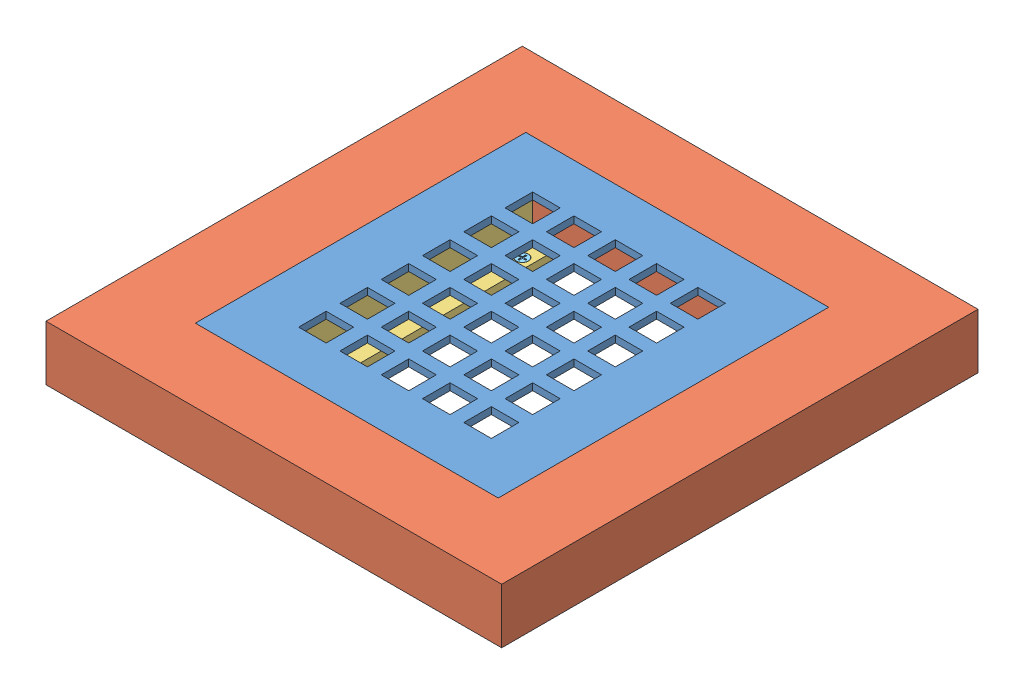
SolidWorks assembly 608(STEP 6A) - Copy.SLDASM, configuration Default (file format 11000). Lengths in mm.
Overall size (139.7 25.4 152.4).
12 component instances, 5 part files, 22 mates.
Components (placement in the parent):
- 208 Lattice Perforated Grille-1: 208 Lattice Perforated Grille.SLDPRT [Default] at origin size (139.7 3.17 152.4)
- wallORfloorORceiling-1: wallORfloorORceiling.SLDPRT [Default] at (0 -23.8125 0) x (0 0 -1) z (0 1 0) size (219.7 210.18 25.4) (hidden)
- Angle-1: Angle.SLDPRT [Default] at (-50.8 -1.5875 -57.15) size (12.7 22.23 114.3)
- Angle-2: Angle.SLDPRT [Default] at (50.8 -1.5875 57.15) x (-1 0 0) z (0 0 -1) size (12.7 22.23 114.3)
- Blocking(Supplied By Contractor)-1: Blocking(Supplied By Contractor).SLDPRT [Default] at (-52.3875 -28.575 38.1) size (38.1 9.53 19.05) (hidden)
- Blocking(Supplied By Contractor)-2: Blocking(Supplied By Contractor).SLDPRT [Default] at (-52.3875 -28.575 -57.15) size (38.1 9.53 19.05) (hidden)
- Blocking(Supplied By Contractor)-5: Blocking(Supplied By Contractor).SLDPRT [Default] at (52.3875 -28.575 -38.1) x (-1 0 0) z (0 0 -1) size (38.1 9.53 19.05) (hidden)
- Blocking(Supplied By Contractor)-6: Blocking(Supplied By Contractor).SLDPRT [Default] at (52.3875 -28.575 57.15) x (-1 0 0) z (0 0 -1) size (38.1 9.53 19.05) (hidden)
- Countersunk Screw(Provided)-1: Countersunk Screw(Provided).SLDPRT [Default] at (-42.8625 -31.9671 -47.625) size (5.55 11.33 5.55) (hidden)
- Countersunk Screw(Provided)-2: Countersunk Screw(Provided).SLDPRT [Default] at (-42.8625 -31.9671 47.625) size (5.55 11.33 5.55) (hidden)
- Countersunk Screw(Provided)-3: Countersunk Screw(Provided).SLDPRT [Default] at (42.8625 -31.9671 47.625) size (5.55 11.33 5.55) (hidden)
- Countersunk Screw(Provided)-4: Countersunk Screw(Provided).SLDPRT [Default] at (42.8625 -31.9671 -47.625) size (5.55 11.33 5.55) (hidden)
Mates (geometry in assembly coordinates):
- Coincident1: coincident: plane of 208 Lattice Perforated Grille-1 through (69.85 -1.5875 76.2) normal (0 -1 0); plane of wallORfloorORceiling-1 through (0 -1.5875 0) normal (0 1 0)
- Coincident2: coincident: plane of 208 Lattice Perforated Grille-1 through (-69.85 -1.5875 76.2) normal (-1 0 0); plane of wallORfloorORceiling-1 through (-69.85 -1.5875 -76.2) normal (1 0 0)
- Coincident3: coincident: plane of 208 Lattice Perforated Grille-1 through (0 0 76.2) normal (0 0 1); plane of wallORfloorORceiling-1 through (69.85 -1.5875 76.2) normal (0 0 -1)
- Coincident4: coincident: plane of wallORfloorORceiling-1 through (-50.8 -23.8125 -57.15) normal (1 0 0); plane of Angle-1 through (-50.8 -1.5875 57.15) normal (-1 0 0)
- Coincident5: coincident: plane of 208 Lattice Perforated Grille-1 through (69.85 -1.5875 76.2) normal (0 -1 0); plane of Angle-1 through (-47.625 -1.5875 57.15) normal (0 1 0)
- Coincident6: coincident: plane of wallORfloorORceiling-1 through (50.8 -23.8125 -57.15) normal (0 0 1); plane of Angle-1 through (-50.8 -1.5875 -57.15) normal (0 0 -1)
- Coincident7: coincident: plane of wallORfloorORceiling-1 through (50.8 -23.8125 -57.15) normal (-1 0 0); plane of Angle-2 through (50.8 -1.5875 -57.15) normal (1 0 0)
- Coincident8: coincident: plane of wallORfloorORceiling-1 through (50.8 -23.8125 57.15) normal (0 0 -1); plane of Angle-2 through (50.8 -1.5875 57.15) normal (0 0 1)
- Coincident9: coincident: plane of wallORfloorORceiling-1 through (0 -23.8125 0) normal (0 -1 0); plane of Angle-2 through (50.8 -23.8125 -57.15) normal (0 -1 0)
- Coincident10: coincident: plane of wallORfloorORceiling-1 through (0 -23.8125 0) normal (0 -1 0); plane of Blocking(Supplied By Contractor)-2 through (-33.3375 -23.8125 -38.1) normal (0 1 0)
- Coincident14: coincident: plane of wallORfloorORceiling-1 through (50.8 -23.8125 57.15) normal (0 0 -1); plane of Blocking(Supplied By Contractor)-1 through (-52.3875 -28.575 57.15) normal (0 0 1)
- Coincident16: coincident: plane of wallORfloorORceiling-1 through (50.8 -23.8125 -57.15) normal (0 0 1); plane of Blocking(Supplied By Contractor)-2 through (-52.3875 -28.575 -57.15) normal (0 0 -1)
- Distance2: distance = 4.7625 mm: plane of Blocking(Supplied By Contractor)-2 through (-33.3375 -33.3375 -38.1) normal (1 0 0); plane of Angle-1 through (-38.1 -23.8125 57.15) normal (1 0 0)
- Coincident21: coincident: plane of Blocking(Supplied By Contractor)-1 through (-33.3375 -33.3375 57.15) normal (1 0 0); plane of Blocking(Supplied By Contractor)-2 through (-33.3375 -33.3375 -38.1) normal (1 0 0)
- Concentric1: concentric: cone of Angle-1 through (-42.8625 -20.6375 -47.625) axis (0 -1 0); cylinder of Countersunk Screw(Provided)-1 through (-42.8625 -21.5833 -47.625) axis (0 1 0) radius 1.543
- Coincident22: coincident: plane of Angle-1 through (-38.1 -20.6375 57.15) normal (0 1 0); plane of Countersunk Screw(Provided)-1 through (-43.5451 -20.6375 -47.625) normal (0 1 0)
- Concentric2: concentric: cone of Angle-1 through (-42.8625 -20.6375 47.625) axis (0 -1 0); cylinder of Countersunk Screw(Provided)-2 through (-42.8625 -21.5833 47.625) axis (0 1 0) radius 1.543
- Coincident23: coincident: plane of Angle-1 through (-38.1 -20.6375 57.15) normal (0 1 0); plane of Countersunk Screw(Provided)-2 through (-43.5451 -20.6375 47.625) normal (0 1 0)
- Coincident24: coincident: plane of Angle-2 through (38.1 -20.6375 -57.15) normal (0 1 0); plane of Countersunk Screw(Provided)-3 through (42.1799 -20.6375 47.625) normal (0 1 0)
- Concentric3: concentric: cone of Angle-2 through (42.8625 -20.6375 47.625) axis (0 -1 0); cylinder of Countersunk Screw(Provided)-3 through (42.8625 -21.5833 47.625) axis (0 1 0) radius 1.543
- Concentric4: concentric: cone of Angle-2 through (42.8625 -20.6375 -47.625) axis (0 -1 0); cylinder of Countersunk Screw(Provided)-4 through (42.8625 -21.5833 -47.625) axis (0 1 0) radius 1.543
- Coincident25: coincident: plane of Angle-2 through (38.1 -20.6375 -57.15) normal (0 1 0); plane of Countersunk Screw(Provided)-4 through (42.1799 -20.6375 -47.625) normal (0 1 0)
